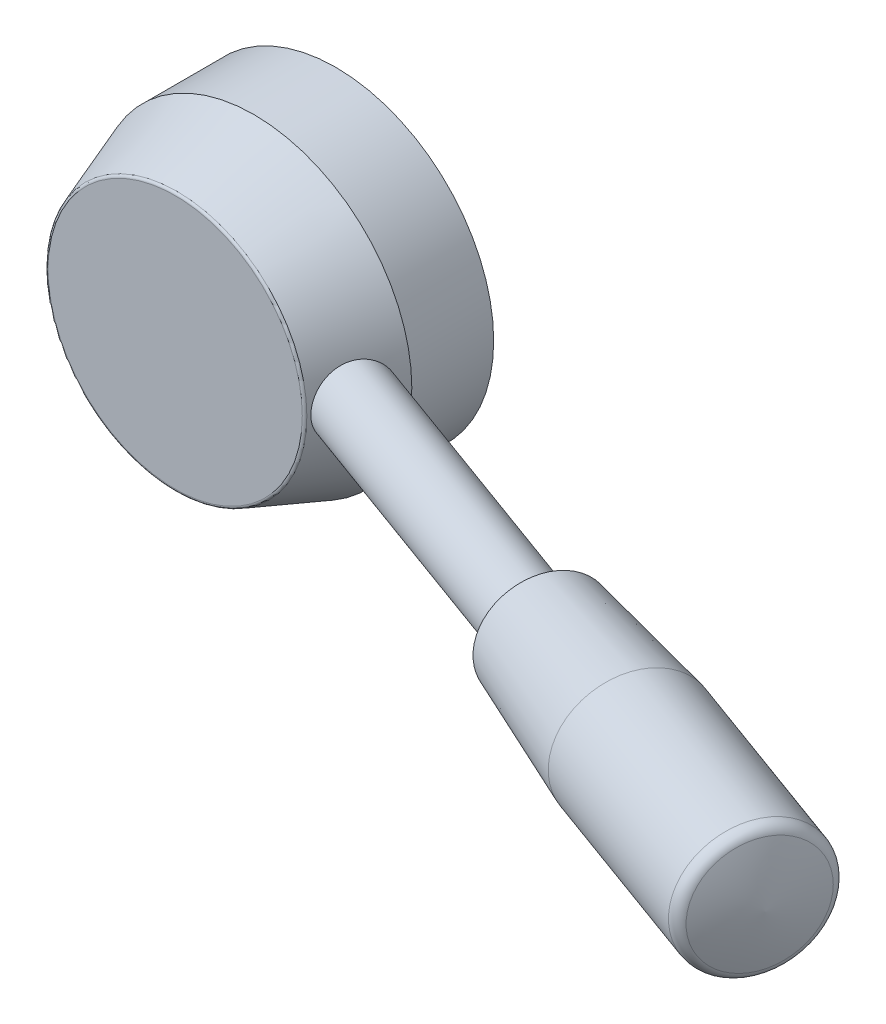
ISO-10303-21;
HEADER;
FILE_DESCRIPTION(('STEP AP214'),'2;1');
FILE_NAME('part.step','',(''),(''),'','','');
FILE_SCHEMA(('AUTOMOTIVE_DESIGN { 1 0 10303 214 1 1 1 1 }'));
ENDSEC;
DATA;
#1=APPLICATION_CONTEXT('core data for automotive mechanical design processes');
#2=APPLICATION_PROTOCOL_DEFINITION('international standard','automotive_design',2000,#1);
#3=PRODUCT_CONTEXT('',#1,'mechanical');
#4=PRODUCT('Part','Part','',(#3));
#5=PRODUCT_RELATED_PRODUCT_CATEGORY('part','',(#4));
#6=PRODUCT_DEFINITION_FORMATION('','',#4);
#7=PRODUCT_DEFINITION_CONTEXT('part definition',#1,'design');
#8=PRODUCT_DEFINITION('design','',#6,#7);
#9=PRODUCT_DEFINITION_SHAPE('','',#8);
#10=(LENGTH_UNIT() NAMED_UNIT(*) SI_UNIT(.MILLI.,.METRE.));
#11=(NAMED_UNIT(*) PLANE_ANGLE_UNIT() SI_UNIT($,.RADIAN.));
#12=(NAMED_UNIT(*) SI_UNIT($,.STERADIAN.) SOLID_ANGLE_UNIT());
#13=UNCERTAINTY_MEASURE_WITH_UNIT(LENGTH_MEASURE(1.E-05),#10,'distance_accuracy_value','');
#14=(GEOMETRIC_REPRESENTATION_CONTEXT(3) GLOBAL_UNCERTAINTY_ASSIGNED_CONTEXT((#13)) GLOBAL_UNIT_ASSIGNED_CONTEXT((#10,
#11,#12)) REPRESENTATION_CONTEXT('',''));
#15=CARTESIAN_POINT('',(0.,0.,0.));
#16=DIRECTION('',(0.,0.,1.));
#17=DIRECTION('',(1.,0.,0.));
#18=AXIS2_PLACEMENT_3D('',#15,#16,#17);
#19=CARTESIAN_POINT('',(-6.,0.,19.));
#20=DIRECTION('',(0.,0.,-1.));
#21=DIRECTION('',(1.,0.,0.));
#22=AXIS2_PLACEMENT_3D('',#19,#20,#21);
#23=PLANE('',#22);
#24=CARTESIAN_POINT('',(0.,0.,19.));
#25=DIRECTION('',(0.,0.,1.));
#26=DIRECTION('',(-1.,0.,0.));
#27=AXIS2_PLACEMENT_3D('',#24,#25,#26);
#28=CIRCLE('',#27,6.);
#29=CARTESIAN_POINT('',(-6.00000000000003,0.,19.));
#30=VERTEX_POINT('',#29);
#31=EDGE_CURVE('E60',#30,#30,#28,.T.);
#32=ORIENTED_EDGE('',*,*,#31,.F.);
#33=EDGE_LOOP('',(#32));
#34=FACE_BOUND('',#33,.T.);
#35=ADVANCED_FACE('F14',(#34),#23,.T.);
#36=CARTESIAN_POINT('',(0.,0.,33.));
#37=DIRECTION('',(0.,0.,1.));
#38=DIRECTION('',(-1.,0.,0.));
#39=AXIS2_PLACEMENT_3D('',#36,#37,#38);
#40=CYLINDRICAL_SURFACE('',#39,6.);
#41=CARTESIAN_POINT('',(0.,0.,0.));
#42=DIRECTION('',(0.,0.,1.));
#43=DIRECTION('',(-1.,0.,0.));
#44=AXIS2_PLACEMENT_3D('',#41,#42,#43);
#45=CIRCLE('',#44,6.);
#46=CARTESIAN_POINT('',(-6.,0.,0.));
#47=VERTEX_POINT('',#46);
#48=EDGE_CURVE('E57',#47,#47,#45,.T.);
#49=ORIENTED_EDGE('',*,*,#48,.F.);
#50=EDGE_LOOP('',(#49));
#51=FACE_BOUND('',#50,.T.);
#52=ORIENTED_EDGE('',*,*,#31,.T.);
#53=EDGE_LOOP('',(#52));
#54=FACE_BOUND('',#53,.T.);
#55=ADVANCED_FACE('F91',(#51,#54),#40,.F.);
#56=CARTESIAN_POINT('',(-27.5,0.,0.));
#57=DIRECTION('',(0.,0.,-1.));
#58=DIRECTION('',(1.,0.,0.));
#59=AXIS2_PLACEMENT_3D('',#56,#57,#58);
#60=PLANE('',#59);
#61=ORIENTED_EDGE('',*,*,#48,.T.);
#62=EDGE_LOOP('',(#61));
#63=FACE_BOUND('',#62,.T.);
#64=CARTESIAN_POINT('',(0.,0.,0.));
#65=DIRECTION('',(0.,0.,1.));
#66=DIRECTION('',(-1.,0.,0.));
#67=AXIS2_PLACEMENT_3D('',#64,#65,#66);
#68=CIRCLE('',#67,27.5);
#69=CARTESIAN_POINT('',(-27.5,0.,0.));
#70=VERTEX_POINT('',#69);
#71=EDGE_CURVE('E54',#70,#70,#68,.T.);
#72=ORIENTED_EDGE('',*,*,#71,.F.);
#73=EDGE_LOOP('',(#72));
#74=FACE_BOUND('',#73,.T.);
#75=ADVANCED_FACE('F96',(#63,#74),#60,.T.);
#76=CARTESIAN_POINT('',(0.,0.,33.));
#77=DIRECTION('',(0.,0.,1.));
#78=DIRECTION('',(-1.,0.,0.));
#79=AXIS2_PLACEMENT_3D('',#76,#77,#78);
#80=CYLINDRICAL_SURFACE('',#79,27.5);
#81=ORIENTED_EDGE('',*,*,#71,.T.);
#82=EDGE_LOOP('',(#81));
#83=FACE_BOUND('',#82,.T.);
#84=CARTESIAN_POINT('',(0.,0.,14.262612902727));
#85=DIRECTION('',(0.,0.,1.));
#86=DIRECTION('',(-1.,0.,0.));
#87=AXIS2_PLACEMENT_3D('',#84,#85,#86);
#88=CIRCLE('',#87,27.5);
#89=CARTESIAN_POINT('',(-27.5,0.,14.262612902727));
#90=VERTEX_POINT('',#89);
#91=EDGE_CURVE('E51',#90,#90,#88,.T.);
#92=ORIENTED_EDGE('',*,*,#91,.F.);
#93=EDGE_LOOP('',(#92));
#94=FACE_BOUND('',#93,.T.);
#95=ADVANCED_FACE('F87',(#83,#94),#80,.T.);
#96=CARTESIAN_POINT('',(0.,0.,27.3420201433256));
#97=DIRECTION('',(0.,0.,-1.));
#98=DIRECTION('',(1.,0.,0.));
#99=AXIS2_PLACEMENT_3D('',#96,#97,#98);
#100=CONICAL_SURFACE('',#99,22.7394850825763,0.349065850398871);
#101=CARTESIAN_POINT('',(0.,0.,27.6710100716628));
#102=DIRECTION('',(0.,0.,-1.));
#103=DIRECTION('',(1.,0.,0.));
#104=AXIS2_PLACEMENT_3D('',#101,#102,#103);
#105=CIRCLE('',#104,22.6197425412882);
#106=CARTESIAN_POINT('',(22.6197425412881,0.,27.6710100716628));
#107=VERTEX_POINT('',#106);
#108=EDGE_CURVE('E9',#107,#107,#105,.T.);
#109=ORIENTED_EDGE('',*,*,#108,.T.);
#110=EDGE_LOOP('',(#109));
#111=FACE_BOUND('',#110,.T.);
#112=CARTESIAN_POINT('',(26.1111979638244,4.0140118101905,17.2355797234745));
#113=CARTESIAN_POINT('',(26.222307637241,3.76520335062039,17.0377102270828));
#114=CARTESIAN_POINT('',(26.3253204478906,3.49743951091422,16.8589187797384));
#115=CARTESIAN_POINT('',(26.5098007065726,2.93113259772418,16.5437003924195));
#116=CARTESIAN_POINT('',(26.5912565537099,2.63257307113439,16.4072962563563));
#117=CARTESIAN_POINT('',(26.7282270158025,2.01271385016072,16.1802017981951));
#118=CARTESIAN_POINT('',(26.7837271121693,1.69140154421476,16.0895370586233));
#119=CARTESIAN_POINT('',(26.8655726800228,1.03539712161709,15.9564389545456));
#120=CARTESIAN_POINT('',(26.8919242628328,0.700707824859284,15.9139954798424));
#121=CARTESIAN_POINT('',(26.9138167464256,0.0323872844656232,15.8787097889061));
#122=CARTESIAN_POINT('',(26.9097790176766,-0.301194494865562,15.8851892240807));
#123=CARTESIAN_POINT('',(26.8721217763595,-0.962266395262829,15.9459674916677));
#124=CARTESIAN_POINT('',(26.8385025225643,-1.2897565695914,16.0002659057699));
#125=CARTESIAN_POINT('',(26.7438125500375,-1.92771629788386,16.1548490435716));
#126=CARTESIAN_POINT('',(26.6828829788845,-2.23826427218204,16.2548973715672));
#127=CARTESIAN_POINT('',(26.5368815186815,-2.83574902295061,16.4984283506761));
#128=CARTESIAN_POINT('',(26.4518075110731,-3.12268372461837,16.6419148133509));
#129=CARTESIAN_POINT('',(26.2603923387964,-3.66970253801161,16.9715720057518));
#130=CARTESIAN_POINT('',(26.1537386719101,-3.92929518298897,17.1583766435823));
#131=CARTESIAN_POINT('',(25.9254212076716,-4.40956954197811,17.569168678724));
#132=CARTESIAN_POINT('',(25.8037556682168,-4.63024673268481,17.7931603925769));
#133=CARTESIAN_POINT('',(25.549386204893,-5.02985787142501,18.2771044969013));
#134=CARTESIAN_POINT('',(25.4165411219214,-5.20809649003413,18.5375576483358));
#135=CARTESIAN_POINT('',(25.1479287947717,-5.51321332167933,19.0856454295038));
#136=CARTESIAN_POINT('',(25.0121617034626,-5.64009421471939,19.3732786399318));
#137=CARTESIAN_POINT('',(24.7451018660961,-5.83774982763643,19.9661773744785));
#138=CARTESIAN_POINT('',(24.6137820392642,-5.9089646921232,20.2712836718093));
#139=CARTESIAN_POINT('',(24.3601205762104,-5.99455445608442,20.8929677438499));
#140=CARTESIAN_POINT('',(24.237777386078,-6.00893921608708,21.2095435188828));
#141=CARTESIAN_POINT('',(24.0091634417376,-5.98065922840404,21.8378538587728));
#142=CARTESIAN_POINT('',(23.9025935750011,-5.93926771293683,22.1495376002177));
#143=CARTESIAN_POINT('',(23.7050843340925,-5.80298452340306,22.7660647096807));
#144=CARTESIAN_POINT('',(23.6141447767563,-5.70809347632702,23.0709081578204));
#145=CARTESIAN_POINT('',(23.4492848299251,-5.46814228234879,23.6639088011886));
#146=CARTESIAN_POINT('',(23.3753159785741,-5.32322802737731,23.9521117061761));
#147=CARTESIAN_POINT('',(23.2436998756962,-4.98739240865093,24.5044369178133));
#148=CARTESIAN_POINT('',(23.1860550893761,-4.79646410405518,24.768555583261));
#149=CARTESIAN_POINT('',(23.084466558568,-4.36884829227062,25.2707228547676));
#150=CARTESIAN_POINT('',(23.0408695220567,-4.13120686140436,25.5080295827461));
#151=CARTESIAN_POINT('',(22.9669407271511,-3.61942425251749,25.9418960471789));
#152=CARTESIAN_POINT('',(22.9366102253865,-3.34527962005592,26.1384519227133));
#153=CARTESIAN_POINT('',(22.8863979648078,-2.76400111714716,26.4863561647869));
#154=CARTESIAN_POINT('',(22.8666524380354,-2.45649565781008,26.6371047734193));
#155=CARTESIAN_POINT('',(22.835859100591,-1.8199611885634,26.8842504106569));
#156=CARTESIAN_POINT('',(22.8248098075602,-1.49093585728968,26.9806567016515));
#157=CARTESIAN_POINT('',(22.8098886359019,-0.827834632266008,27.113775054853));
#158=CARTESIAN_POINT('',(22.8058750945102,-0.493998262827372,27.1516634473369));
#159=CARTESIAN_POINT('',(22.8039223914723,0.175236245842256,27.1698713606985));
#160=CARTESIAN_POINT('',(22.8059824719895,0.510634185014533,27.1501980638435));
#161=CARTESIAN_POINT('',(22.8164189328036,1.16638718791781,27.0551135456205));
#162=CARTESIAN_POINT('',(22.824667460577,1.48690912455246,26.9808311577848));
#163=CARTESIAN_POINT('',(22.8485486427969,2.11114192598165,26.7807418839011));
#164=CARTESIAN_POINT('',(22.8641819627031,2.41485127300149,26.6549303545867));
#165=CARTESIAN_POINT('',(22.9049940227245,3.00145010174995,26.3543230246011));
#166=CARTESIAN_POINT('',(22.9302985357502,3.28400393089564,26.1788900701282));
#167=CARTESIAN_POINT('',(22.9927787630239,3.81649958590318,25.7857095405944));
#168=CARTESIAN_POINT('',(23.029956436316,4.06643602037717,25.5679549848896));
#169=CARTESIAN_POINT('',(23.1196351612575,4.53311580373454,25.0910096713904));
#170=CARTESIAN_POINT('',(23.1724973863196,4.74886861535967,24.8309161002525));
#171=CARTESIAN_POINT('',(23.2951488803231,5.13335818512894,24.2815770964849));
#172=CARTESIAN_POINT('',(23.3649375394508,5.30209663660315,23.9923327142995));
#173=CARTESIAN_POINT('',(23.5220773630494,5.58695656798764,23.394741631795));
#174=CARTESIAN_POINT('',(23.6093637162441,5.70326722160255,23.0864682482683));
#175=CARTESIAN_POINT('',(23.8010126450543,5.88037181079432,22.4594799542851));
#176=CARTESIAN_POINT('',(23.9053719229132,5.94117645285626,22.1407670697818));
#177=CARTESIAN_POINT('',(24.1259860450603,6.00447337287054,21.5105745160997));
#178=CARTESIAN_POINT('',(24.2418849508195,6.00836383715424,21.1991098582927));
#179=CARTESIAN_POINT('',(24.483840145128,5.96135967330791,20.5843388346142));
#180=CARTESIAN_POINT('',(24.6098974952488,5.91045931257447,20.2810333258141));
#181=CARTESIAN_POINT('',(24.8666172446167,5.75591145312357,19.6919626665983));
#182=CARTESIAN_POINT('',(24.9972570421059,5.65249608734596,19.4061264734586));
#183=CARTESIAN_POINT('',(25.2580536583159,5.3961853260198,18.857502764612));
#184=CARTESIAN_POINT('',(25.3882106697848,5.24331247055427,18.5947048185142));
#185=CARTESIAN_POINT('',(25.6210917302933,4.92163012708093,18.1393034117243));
#186=CARTESIAN_POINT('',(25.7247793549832,4.75969425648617,17.942293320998));
#187=CARTESIAN_POINT('',(25.9245073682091,4.4073827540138,17.5711484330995));
#188=CARTESIAN_POINT('',(26.0205474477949,4.21700597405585,17.39701455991));
#189=CARTESIAN_POINT('',(26.1111979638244,4.0140118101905,17.2355797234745));
#190=B_SPLINE_CURVE_WITH_KNOTS('',3,(#112,#113,#114,#115,#116,#117,#118,#119,#120,#121,#122,
#123,#124,#125,#126,#127,#128,#129,#130,#131,#132,#133,#134,#135,#136,#137,#138,#139,#140,#141,
#142,#143,#144,#145,#146,#147,#148,#149,#150,#151,#152,#153,#154,#155,#156,#157,#158,#159,#160,
#161,#162,#163,#164,#165,#166,#167,#168,#169,#170,#171,#172,#173,#174,#175,#176,#177,#178,#179,
#180,#181,#182,#183,#184,#185,#186,#187,#188,#189),.UNSPECIFIED.,.T.,.F.,(4,2,2,2,2,2,2,2,2,2,2,
2,2,2,2,2,2,2,2,2,2,2,2,2,2,2,2,2,2,2,2,2,2,2,2,2,2,2,4),(0.,1.00929775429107,2.01913756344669,
3.02954156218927,4.03973367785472,5.03594479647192,6.03214720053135,7.02325927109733,
8.01445833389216,9.02119671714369,10.0280520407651,11.0504159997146,12.0727266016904,
13.0868697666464,14.1008369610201,15.0920456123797,16.0832426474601,17.0715729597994,
18.0600524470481,19.071332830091,20.0827089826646,21.106807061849,22.1307305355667,
23.133790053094,24.1367244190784,25.1194899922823,26.1023441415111,27.098440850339,
28.0947019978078,29.1159677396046,30.1371966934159,31.1547106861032,32.1720283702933,
33.1643108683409,34.1566971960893,35.1447345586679,36.1323222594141,36.9557399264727,
37.7791908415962),.UNSPECIFIED.);
#191=CARTESIAN_POINT('',(26.1111979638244,4.0140118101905,17.2355797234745));
#192=VERTEX_POINT('',#191);
#193=EDGE_CURVE('E50',#192,#192,#190,.T.);
#194=ORIENTED_EDGE('',*,*,#193,.T.);
#195=EDGE_LOOP('',(#194));
#196=FACE_BOUND('',#195,.T.);
#197=ORIENTED_EDGE('',*,*,#91,.T.);
#198=EDGE_LOOP('',(#197));
#199=FACE_BOUND('',#198,.T.);
#200=ADVANCED_FACE('F69',(#111,#196,#199),#100,.T.);
#201=CARTESIAN_POINT('',(-21.7997924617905,0.,28.));
#202=DIRECTION('',(0.,0.,1.));
#203=DIRECTION('',(-1.,0.,0.));
#204=AXIS2_PLACEMENT_3D('',#201,#202,#203);
#205=PLANE('',#204);
#206=CARTESIAN_POINT('',(0.,0.,28.));
#207=DIRECTION('',(0.,0.,1.));
#208=DIRECTION('',(-1.,0.,0.));
#209=AXIS2_PLACEMENT_3D('',#206,#207,#208);
#210=CIRCLE('',#209,22.1498962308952);
#211=CARTESIAN_POINT('',(-22.1498962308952,0.,28.));
#212=VERTEX_POINT('',#211);
#213=EDGE_CURVE('E20',#212,#212,#210,.T.);
#214=ORIENTED_EDGE('',*,*,#213,.T.);
#215=EDGE_LOOP('',(#214));
#216=FACE_BOUND('',#215,.T.);
#217=ADVANCED_FACE('F78',(#216),#205,.T.);
#218=CARTESIAN_POINT('',(-0.00901926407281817,0.,12.474366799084));
#219=DIRECTION('',(-0.939692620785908,0.,-0.34202014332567));
#220=DIRECTION('',(0.34202014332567,0.,-0.939692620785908));
#221=AXIS2_PLACEMENT_3D('',#218,#219,#220);
#222=CYLINDRICAL_SURFACE('',#221,5.99999999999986);
#223=CARTESIAN_POINT('',(76.2418115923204,0.,40.2273995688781));
#224=DIRECTION('',(-0.939692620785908,0.,-0.34202014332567));
#225=DIRECTION('',(0.34202014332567,0.,-0.939692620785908));
#226=AXIS2_PLACEMENT_3D('',#223,#224,#225);
#227=CIRCLE('',#226,5.99999999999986);
#228=CARTESIAN_POINT('',(78.2939324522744,0.,34.5892438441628));
#229=VERTEX_POINT('',#228);
#230=EDGE_CURVE('E47',#229,#229,#227,.T.);
#231=ORIENTED_EDGE('',*,*,#230,.T.);
#232=EDGE_LOOP('',(#231));
#233=FACE_BOUND('',#232,.T.);
#234=ORIENTED_EDGE('',*,*,#193,.F.);
#235=EDGE_LOOP('',(#234));
#236=FACE_BOUND('',#235,.T.);
#237=ADVANCED_FACE('F73',(#233,#236),#222,.T.);
#238=CARTESIAN_POINT('',(73.3012233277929,0.,48.3065994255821));
#239=DIRECTION('',(0.939692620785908,0.,0.34202014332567));
#240=DIRECTION('',(-0.34202014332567,0.,0.939692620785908));
#241=AXIS2_PLACEMENT_3D('',#238,#239,#240);
#242=PLANE('',#241);
#243=ORIENTED_EDGE('',*,*,#230,.F.);
#244=EDGE_LOOP('',(#243));
#245=FACE_BOUND('',#244,.T.);
#246=CARTESIAN_POINT('',(76.2418115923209,0.,40.2273995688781));
#247=DIRECTION('',(-0.939692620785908,0.,-0.34202014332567));
#248=DIRECTION('',(0.34202014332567,0.,-0.939692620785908));
#249=AXIS2_PLACEMENT_3D('',#246,#247,#248);
#250=CIRCLE('',#249,8.59770490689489);
#251=CARTESIAN_POINT('',(79.1823998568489,0.,32.1481997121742));
#252=VERTEX_POINT('',#251);
#253=EDGE_CURVE('E44',#252,#252,#250,.T.);
#254=ORIENTED_EDGE('',*,*,#253,.T.);
#255=EDGE_LOOP('',(#254));
#256=FACE_BOUND('',#255,.T.);
#257=ADVANCED_FACE('F77',(#245,#256),#242,.F.);
#258=CARTESIAN_POINT('',(77.1441664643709,0.,40.5558298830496));
#259=DIRECTION('',(-0.939692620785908,0.,-0.34202014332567));
#260=DIRECTION('',(0.34202014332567,0.,-0.939692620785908));
#261=AXIS2_PLACEMENT_3D('',#258,#259,#260);
#262=TOROIDAL_SURFACE('',#261,8.87679129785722,1.00000000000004);
#263=ORIENTED_EDGE('',*,*,#253,.F.);
#264=EDGE_LOOP('',(#263));
#265=FACE_BOUND('',#264,.T.);
#266=CARTESIAN_POINT('',(76.4656343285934,0.,40.3088643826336));
#267=DIRECTION('',(-0.939692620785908,0.,-0.34202014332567));
#268=DIRECTION('',(0.34202014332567,0.,-0.939692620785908));
#269=AXIS2_PLACEMENT_3D('',#266,#267,#268);
#270=CIRCLE('',#269,9.56860209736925);
#271=CARTESIAN_POINT('',(79.7382889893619,0.,31.3173196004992));
#272=VERTEX_POINT('',#271);
#273=EDGE_CURVE('E41',#272,#272,#270,.T.);
#274=ORIENTED_EDGE('',*,*,#273,.T.);
#275=EDGE_LOOP('',(#274));
#276=FACE_BOUND('',#275,.T.);
#277=ADVANCED_FACE('F149',(#265,#276),#262,.T.);
#278=CARTESIAN_POINT('',(100.967059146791,0.,49.2266537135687));
#279=DIRECTION('',(0.939692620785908,0.,0.34202014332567));
#280=DIRECTION('',(-0.34202014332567,0.,0.939692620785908));
#281=AXIS2_PLACEMENT_3D('',#278,#279,#280);
#282=CONICAL_SURFACE('',#281,11.5,0.0739390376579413);
#283=ORIENTED_EDGE('',*,*,#273,.F.);
#284=EDGE_LOOP('',(#283));
#285=FACE_BOUND('',#284,.T.);
#286=CARTESIAN_POINT('',(100.967059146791,0.,49.2266537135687));
#287=DIRECTION('',(-0.939692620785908,0.,-0.34202014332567));
#288=DIRECTION('',(0.34202014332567,0.,-0.939692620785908));
#289=AXIS2_PLACEMENT_3D('',#286,#287,#288);
#290=CIRCLE('',#289,11.5);
#291=CARTESIAN_POINT('',(104.900290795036,0.,38.4201885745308));
#292=VERTEX_POINT('',#291);
#293=EDGE_CURVE('E36',#292,#292,#290,.T.);
#294=ORIENTED_EDGE('',*,*,#293,.T.);
#295=EDGE_LOOP('',(#294));
#296=FACE_BOUND('',#295,.T.);
#297=ADVANCED_FACE('F158',(#285,#296),#282,.T.);
#298=CARTESIAN_POINT('',(-0.00901926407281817,0.,12.474366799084));
#299=DIRECTION('',(-0.939692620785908,0.,-0.34202014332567));
#300=DIRECTION('',(0.34202014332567,0.,-0.939692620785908));
#301=AXIS2_PLACEMENT_3D('',#298,#299,#300);
#302=CYLINDRICAL_SURFACE('',#301,11.5);
#303=CARTESIAN_POINT('',(133.903759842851,0.,61.2146323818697));
#304=DIRECTION('',(-0.939692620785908,0.,-0.34202014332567));
#305=DIRECTION('',(0.34202014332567,0.,-0.939692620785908));
#306=AXIS2_PLACEMENT_3D('',#303,#304,#305);
#307=CIRCLE('',#306,11.5);
#308=CARTESIAN_POINT('',(137.836991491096,0.,50.4081672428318));
#309=VERTEX_POINT('',#308);
#310=EDGE_CURVE('E33',#309,#309,#307,.T.);
#311=ORIENTED_EDGE('',*,*,#310,.T.);
#312=EDGE_LOOP('',(#311));
#313=FACE_BOUND('',#312,.T.);
#314=ORIENTED_EDGE('',*,*,#293,.F.);
#315=EDGE_LOOP('',(#314));
#316=FACE_BOUND('',#315,.T.);
#317=ADVANCED_FACE('F167',(#313,#316),#302,.T.);
#318=CARTESIAN_POINT('',(133.903759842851,0.,61.2146323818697));
#319=DIRECTION('',(-0.939692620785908,0.,-0.34202014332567));
#320=DIRECTION('',(0.34202014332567,0.,-0.939692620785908));
#321=AXIS2_PLACEMENT_3D('',#318,#319,#320);
#322=TOROIDAL_SURFACE('',#321,9.5,2.);
#323=ORIENTED_EDGE('',*,*,#310,.F.);
#324=EDGE_LOOP('',(#323));
#325=FACE_BOUND('',#324,.T.);
#326=CARTESIAN_POINT('',(135.721649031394,0.,61.8762899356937));
#327=DIRECTION('',(-0.939692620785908,0.,-0.34202014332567));
#328=DIRECTION('',(0.34202014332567,0.,-0.939692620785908));
#329=AXIS2_PLACEMENT_3D('',#326,#327,#328);
#330=CIRCLE('',#329,10.0074329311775);
#331=CARTESIAN_POINT('',(139.144392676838,0.,52.4723790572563));
#332=VERTEX_POINT('',#331);
#333=EDGE_CURVE('E31',#332,#332,#330,.T.);
#334=ORIENTED_EDGE('',*,*,#333,.T.);
#335=EDGE_LOOP('',(#334));
#336=FACE_BOUND('',#335,.T.);
#337=ADVANCED_FACE('F27',(#325,#336),#322,.T.);
#338=CARTESIAN_POINT('',(81.6219884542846,0.,47.133699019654));
#339=DIRECTION('',(0.,1.,0.));
#340=DIRECTION('',(0.34202014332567,0.,-0.939692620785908));
#341=AXIS2_PLACEMENT_3D('',#338,#339,#340);
#342=CIRCLE('',#341,57.7696156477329);
#343=TRIMMED_CURVE('',#342,(PARAMETER_VALUE(-1.49022274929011)),
(PARAMETER_VALUE(1.49022274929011)),.T.,.PARAMETER.);
#344=CARTESIAN_POINT('',(83.2122691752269,0.,42.7644386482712));
#345=DIRECTION('',(-0.939692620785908,0.,-0.34202014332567));
#346=AXIS1_PLACEMENT('',#344,#345);
#347=SURFACE_OF_REVOLUTION('',#343,#346);
#348=CARTESIAN_POINT('',(137.321831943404,0.,62.4587088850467));
#349=VERTEX_POINT('',#348);
#350=VERTEX_LOOP('',#349);
#351=FACE_BOUND('',#350,.T.);
#352=ORIENTED_EDGE('',*,*,#333,.F.);
#353=EDGE_LOOP('',(#352));
#354=FACE_BOUND('',#353,.T.);
#355=ADVANCED_FACE('F23',(#351,#354),#347,.T.);
#356=CARTESIAN_POINT('',(0.,0.,27.5));
#357=DIRECTION('',(0.,0.,1.));
#358=DIRECTION('',(-1.,0.,0.));
#359=AXIS2_PLACEMENT_3D('',#356,#357,#358);
#360=TOROIDAL_SURFACE('',#359,22.1498962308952,0.5);
#361=ORIENTED_EDGE('',*,*,#108,.F.);
#362=EDGE_LOOP('',(#361));
#363=FACE_BOUND('',#362,.T.);
#364=ORIENTED_EDGE('',*,*,#213,.F.);
#365=EDGE_LOOP('',(#364));
#366=FACE_BOUND('',#365,.T.);
#367=ADVANCED_FACE('F26',(#363,#366),#360,.T.);
#368=CLOSED_SHELL('',(#35,#55,#75,#95,#200,#217,#237,#257,#277,#297,#317,#337,#355,#367));
#369=MANIFOLD_SOLID_BREP('B1',#368);
#370=ADVANCED_BREP_SHAPE_REPRESENTATION('',(#18,#369),#14);
#371=SHAPE_DEFINITION_REPRESENTATION(#9,#370);
ENDSEC;
END-ISO-10303-21;
